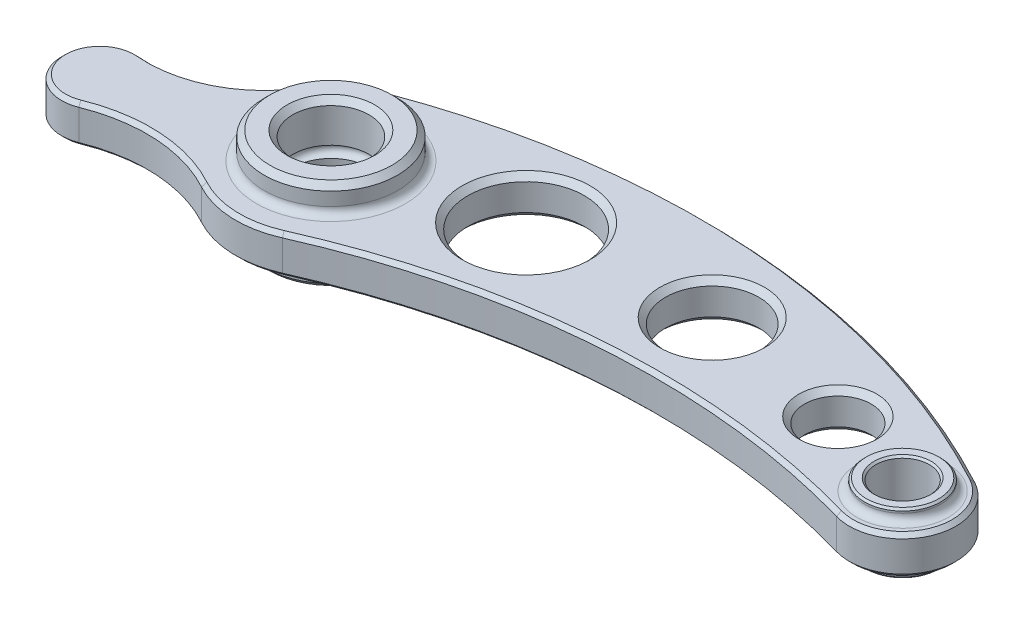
from build123d import *

# Parameters (mm, degrees)
SKETCH1_R           = 10
SKETCH1_R_2         = 7
SKETCH1_R_3         = 15.306383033
SKETCH1_R_4         = 8.74419125
SKETCH1_R_5         = 12.238235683
BOSS_EXTRUDE1_DEPTH = 5
SKETCH2_R           = 17.5
SKETCH2_R_2         = 10
BOSS_EXTRUDE2_DEPTH = 12
SKETCH3_R           = 10
SKETCH3_R_2         = 7
BOSS_EXTRUDE3_DEPTH = 8
CHAMFER1_SIZE       = 1
FILLET1_R           = 2
CHAMFER2_SIZE       = 1.5
CHAMFER3_SIZE       = 0.5
SKETCH4_R           = 1.5
CHAMFER4_SIZE       = 1.5


with BuildPart() as part:
    # Sketch1 → Boss-Extrude1 (new, symmetric)
    with BuildSketch(Plane(origin=(0, 0, 0), x_dir=(1, 0, 0), z_dir=(0, 1, 0))):
        with BuildLine():
            ThreePointArc((-8.823333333, 23.391211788), (-15.82896568, 19.350551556), (-21.178107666, 13.284869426))
            ThreePointArc((-21.178107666, 13.284869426), (-33.20297461, 2.380141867), (-49.147959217, -0.664192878))
            ThreePointArc((-49.147959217, -0.664192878), (-59.8886599, -12.115915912), (-46.253357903, -19.899433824))
            ThreePointArc((-46.253357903, -19.899433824), (-28.91231533, -17.055211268), (-12.025688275, -21.917637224))
            ThreePointArc((-12.025688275, -21.917637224), (-1.061996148, -24.977433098), (10.121851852, -22.859311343))
            ThreePointArc((10.121851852, -22.859311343), (77.308394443, -6.209659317), (146.146510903, -13.459220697))
            ThreePointArc((146.146510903, -13.459220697), (162.966958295, -5.278067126), (156.641469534, 12.32440191))
            ThreePointArc((156.641469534, 12.32440191), (75.110147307, 35.815676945), (-8.823333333, 23.391211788))
        make_face()
        with Locations(Location((0, 0, 0), (0, 0, 270))):
            Circle(SKETCH1_R, mode=Mode.SUBTRACT)
        with Locations(Location((150, 0, 0), (0, 0, 270))):
            Circle(SKETCH1_R_2, mode=Mode.SUBTRACT)
        with Locations(Location((39.653942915, 11.566420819, 0), (0, 0, 270))):
            Circle(SKETCH1_R_3, mode=Mode.SUBTRACT)
        with Locations(Location((124.610444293, 8.403703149, 0), (0, 0, 270))):
            Circle(SKETCH1_R_4, mode=Mode.SUBTRACT)
        with Locations(Location((85.600343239, 14.435839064, 0), (0, 0, 270))):
            Circle(SKETCH1_R_5, mode=Mode.SUBTRACT)
    extrude(amount=BOSS_EXTRUDE1_DEPTH, both=True)

    # Sketch2 → Boss-Extrude2 (add, symmetric)
    with BuildSketch(Plane(origin=(0, 0, 0), x_dir=(1, 0, 0), z_dir=(0, 1, 0))):
        with Locations(Location((0, 0, 0), (0, 0, 90))):
            Circle(SKETCH2_R)
        with Locations(Location((0, 0, 0), (0, 0, 270))):
            Circle(SKETCH2_R_2, mode=Mode.SUBTRACT)
    extrude(amount=BOSS_EXTRUDE2_DEPTH, both=True)

    # Sketch3 → Boss-Extrude3 (add, symmetric)
    with BuildSketch(Plane(origin=(0, 0, 0), x_dir=(1, 0, 0), z_dir=(0, 1, 0))):
        with Locations(Location((150, 0, 0), (0, 0, 90))):
            Circle(SKETCH3_R)
        with Locations(Location((150, 0, 0), (0, 0, 270))):
            Circle(SKETCH3_R_2, mode=Mode.SUBTRACT)
    extrude(amount=BOSS_EXTRUDE3_DEPTH, both=True)

    # Chamfer1
    chamfer1_edges = [part.edges().sort_by_distance(p)[0] for p in [
        (75.110147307, 5, -35.815676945),
        (162.966958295, -5, 5.278067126),
        (77.308394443, -5, 6.209659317),
        (-15.82896568, 5, -19.350551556),
        (-33.20297461, 5, -2.380141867),
        (-59.8886599, 5, 12.115915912),
        (-28.91231533, 5, 17.055211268),
        (-1.061996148, 5, 24.977433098),
        (77.308394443, 5, 6.209659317),
        (162.966958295, 5, 5.278067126),
        (-1.061996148, -5, 24.977433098),
        (-28.91231533, -5, 17.055211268),
        (-59.8886599, -5, 12.115915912),
        (-33.20297461, -5, -2.380141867),
        (-15.82896568, -5, -19.350551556),
        (75.110147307, -5, -35.815676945),
    ]]
    chamfer(chamfer1_edges, length=CHAMFER1_SIZE)

    # Fillet1
    fillet1_edges = [part.edges().sort_by_distance(p)[0] for p in [
        (0, 5, 17.5),
        (0, -5, 17.5),
        (150, 5, 10),
        (150, -5, 10),
    ]]
    fillet(fillet1_edges, radius=FILLET1_R)

    # Chamfer2
    chamfer2_edges = [part.edges().sort_by_distance(p)[0] for p in [
        (0, 12, -10),
        (0, 12, 17.5),
        (0, -12, -10),
        (0, -12, 17.5),
    ]]
    chamfer(chamfer2_edges, length=CHAMFER2_SIZE)

    # Chamfer3
    chamfer3_edges = [part.edges().sort_by_distance(p)[0] for p in [
        (150, 8, -7),
        (150, 8, 10),
        (150, -8, -7),
        (150, -8, 10),
    ]]
    chamfer(chamfer3_edges, length=CHAMFER3_SIZE)

    # Sketch4 → Cut-Revolve1 (revolve, cut)
    with BuildSketch(Plane.XY, mode=Mode.PRIVATE) as cut_revolve1_sk:
        with Locations((-10, 0)):
            Circle(SKETCH4_R)
    revolve(cut_revolve1_sk.sketch.rotate(Axis((0, 0, 0), (0, 1, 0)), 90), axis=Axis((0, 0, 0), (0, 1, 0)), mode=Mode.SUBTRACT)

    # Chamfer4
    chamfer4_edges = [part.edges().sort_by_distance(p)[0] for p in [
        (39.653942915, -5, -26.872803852),
        (39.653942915, 5, -26.872803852),
        (124.610444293, -5, -17.1478944),
        (124.610444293, 5, -17.1478944),
        (85.600343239, -5, -26.674074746),
        (85.600343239, 5, -26.674074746),
    ]]
    chamfer(chamfer4_edges, length=CHAMFER4_SIZE)


solid = part.part
